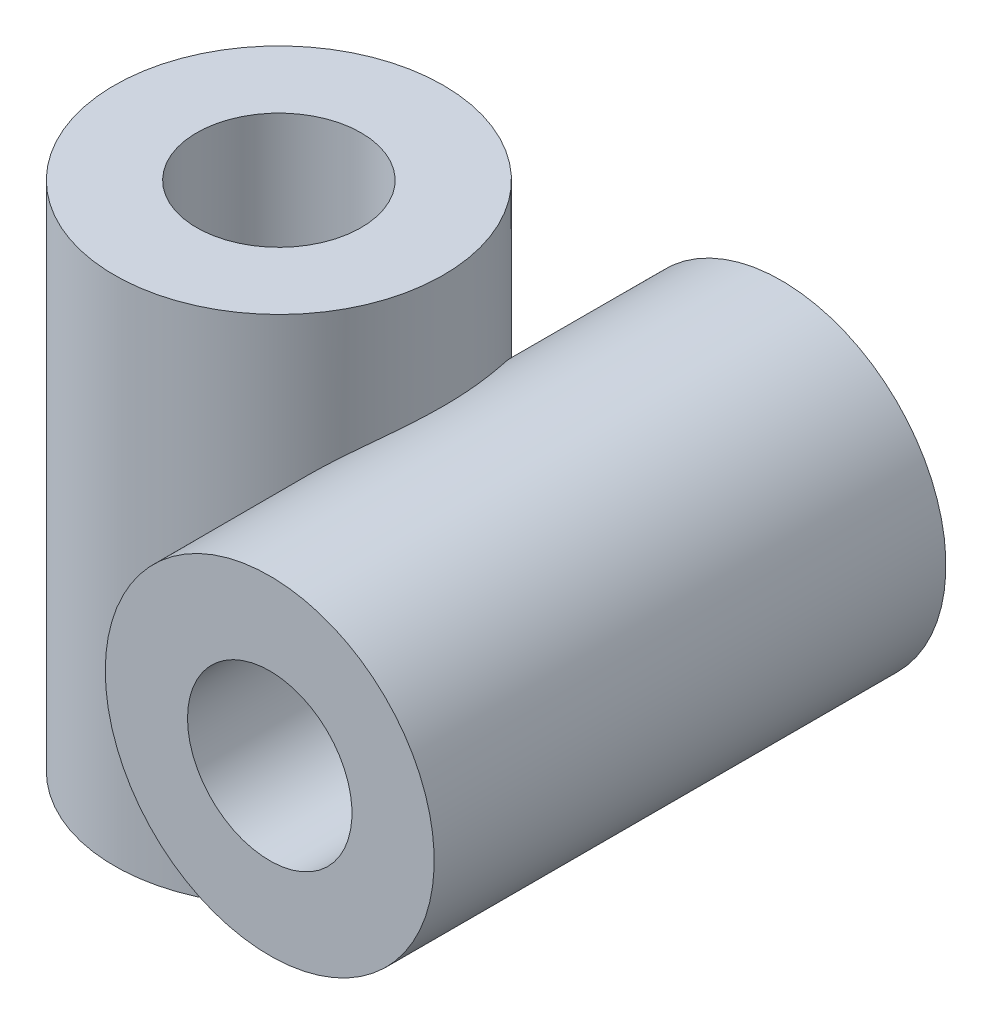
from build123d import *

# Parameters (mm, degrees)
SKETCH1_W                = 9
SKETCH1_H                = 28
SKETCH2_W                = 9
SKETCH2_H                = 28
F_9_0_9_DIAMETER_HOLE1_D = 9
F_9_0_9_DIAMETER_HOLE2_D = 9


with BuildPart() as part:
    # Sketch1 → Revolve1 (revolve)
    with BuildSketch(Plane.XZ, mode=Mode.PRIVATE) as revolve1_sk:
        with Locations((18, 0)):
            Rectangle(SKETCH1_W, SKETCH1_H)
    revolve(revolve1_sk.sketch.rotate(Axis((13.5, 0, 14.003035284), (0, 0, -1)), 180), axis=Axis((13.5, 0, 14.003035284), (0, 0, -1)))

    # Sketch2 → Revolve2 (revolve)
    with BuildSketch(Plane(origin=(0, 0, 0), x_dir=(0, 0, -1), z_dir=(1, 0, 0))):
        with Locations((4.5, 0)):
            Rectangle(SKETCH2_W, SKETCH2_H)
    revolve(axis=Axis((0, 14, 0), (0, -1, 0)))

    # 9.0 _9_ Diameter Hole1 (through all)
    with Locations(Plane(origin=(0, -14, 0), x_dir=(-1, 0, 0), z_dir=(0, -1, 0))):
        with Locations((0, 0)):
            Hole(F_9_0_9_DIAMETER_HOLE1_D / 2)

    # 9.0 _9_ Diameter Hole2 (through all)
    with Locations(Plane(origin=(0, 0, -14), x_dir=(-1, 0, 0), z_dir=(0, 0, -1))):
        with Locations((-13.5, 0)):
            Hole(F_9_0_9_DIAMETER_HOLE2_D / 2)


solid = part.part
